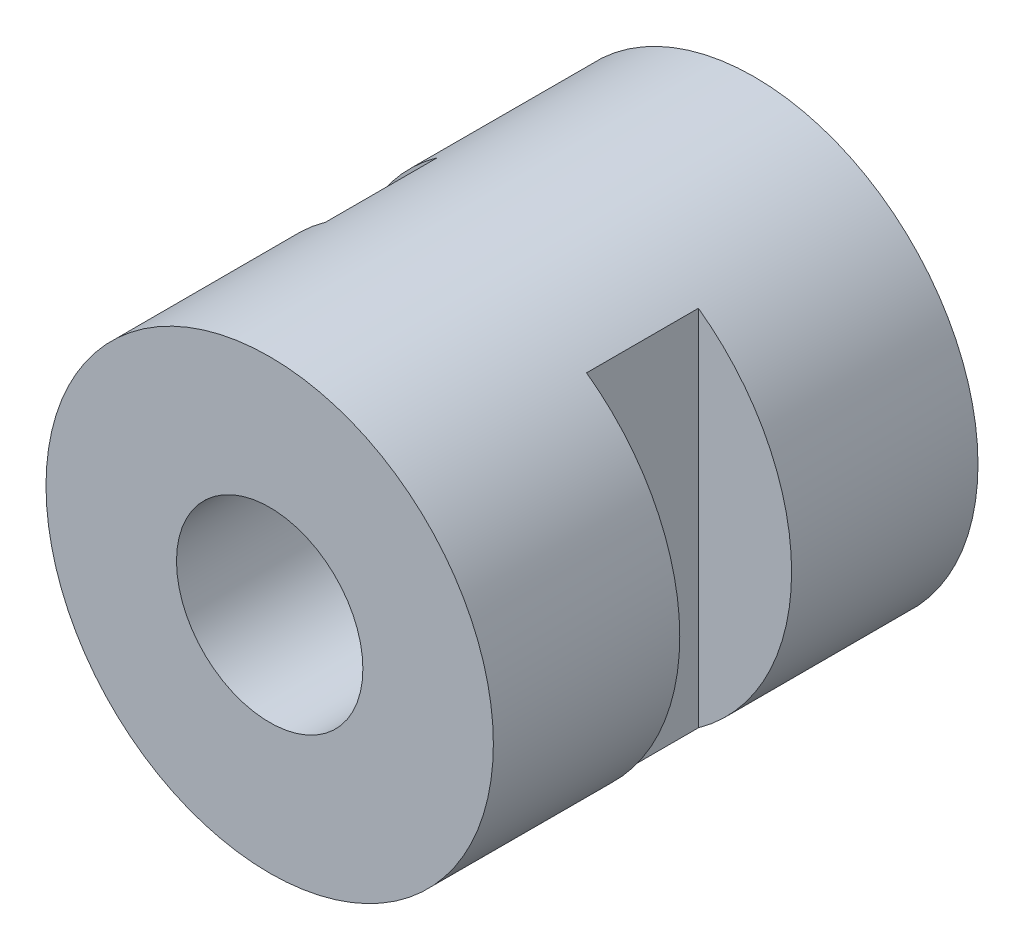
ISO-10303-21;
HEADER;
FILE_DESCRIPTION(('STEP AP214'),'2;1');
FILE_NAME('part.step','',(''),(''),'','','');
FILE_SCHEMA(('AUTOMOTIVE_DESIGN { 1 0 10303 214 1 1 1 1 }'));
ENDSEC;
DATA;
#1=APPLICATION_CONTEXT('core data for automotive mechanical design processes');
#2=APPLICATION_PROTOCOL_DEFINITION('international standard','automotive_design',2000,#1);
#3=PRODUCT_CONTEXT('',#1,'mechanical');
#4=PRODUCT('Part','Part','',(#3));
#5=PRODUCT_RELATED_PRODUCT_CATEGORY('part','',(#4));
#6=PRODUCT_DEFINITION_FORMATION('','',#4);
#7=PRODUCT_DEFINITION_CONTEXT('part definition',#1,'design');
#8=PRODUCT_DEFINITION('design','',#6,#7);
#9=PRODUCT_DEFINITION_SHAPE('','',#8);
#10=(LENGTH_UNIT() NAMED_UNIT(*) SI_UNIT(.MILLI.,.METRE.));
#11=(NAMED_UNIT(*) PLANE_ANGLE_UNIT() SI_UNIT($,.RADIAN.));
#12=(NAMED_UNIT(*) SI_UNIT($,.STERADIAN.) SOLID_ANGLE_UNIT());
#13=UNCERTAINTY_MEASURE_WITH_UNIT(LENGTH_MEASURE(1.E-05),#10,'distance_accuracy_value','');
#14=(GEOMETRIC_REPRESENTATION_CONTEXT(3) GLOBAL_UNCERTAINTY_ASSIGNED_CONTEXT((#13)) GLOBAL_UNIT_ASSIGNED_CONTEXT((#10,
#11,#12)) REPRESENTATION_CONTEXT('',''));
#15=CARTESIAN_POINT('',(0.,0.,0.));
#16=DIRECTION('',(0.,0.,1.));
#17=DIRECTION('',(1.,0.,0.));
#18=AXIS2_PLACEMENT_3D('',#15,#16,#17);
#19=CARTESIAN_POINT('',(0.,0.,13.));
#20=DIRECTION('',(0.,0.,-1.));
#21=DIRECTION('',(-1.,0.,0.));
#22=AXIS2_PLACEMENT_3D('',#19,#20,#21);
#23=CYLINDRICAL_SURFACE('',#22,6.);
#24=CARTESIAN_POINT('',(0.,0.,8.));
#25=DIRECTION('',(0.,0.,1.));
#26=DIRECTION('',(1.,0.,0.));
#27=AXIS2_PLACEMENT_3D('',#24,#25,#26);
#28=CIRCLE('',#27,6.);
#29=CARTESIAN_POINT('',(-3.5,4.87339717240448,8.));
#30=VERTEX_POINT('',#29);
#31=CARTESIAN_POINT('',(-3.5,-4.87339717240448,8.));
#32=VERTEX_POINT('',#31);
#33=EDGE_CURVE('E39',#30,#32,#28,.T.);
#34=ORIENTED_EDGE('',*,*,#33,.T.);
#35=DIRECTION('',(0.,0.,-1.));
#36=VECTOR('',#35,1.);
#37=CARTESIAN_POINT('',(-3.5,-4.87339717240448,13.));
#38=LINE('',#37,#36);
#39=CARTESIAN_POINT('',(-3.5,-4.87339717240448,5.00000000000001));
#40=VERTEX_POINT('',#39);
#41=EDGE_CURVE('E11',#32,#40,#38,.T.);
#42=ORIENTED_EDGE('',*,*,#41,.T.);
#43=CARTESIAN_POINT('',(0.,0.,5.00000000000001));
#44=DIRECTION('',(0.,0.,-1.));
#45=DIRECTION('',(-1.,0.,0.));
#46=AXIS2_PLACEMENT_3D('',#43,#44,#45);
#47=CIRCLE('',#46,6.);
#48=CARTESIAN_POINT('',(-3.5,4.87339717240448,5.00000000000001));
#49=VERTEX_POINT('',#48);
#50=EDGE_CURVE('E83',#40,#49,#47,.T.);
#51=ORIENTED_EDGE('',*,*,#50,.T.);
#52=DIRECTION('',(0.,0.,-1.));
#53=VECTOR('',#52,1.);
#54=CARTESIAN_POINT('',(-3.5,4.87339717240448,13.));
#55=LINE('',#54,#53);
#56=EDGE_CURVE('E82',#49,#30,#55,.F.);
#57=ORIENTED_EDGE('',*,*,#56,.T.);
#58=EDGE_LOOP('',(#34,#42,#51,#57));
#59=FACE_BOUND('',#58,.T.);
#60=DIRECTION('',(0.,0.,-1.));
#61=VECTOR('',#60,1.);
#62=CARTESIAN_POINT('',(3.5,-4.87339717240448,13.));
#63=LINE('',#62,#61);
#64=CARTESIAN_POINT('',(3.5,-4.87339717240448,5.));
#65=VERTEX_POINT('',#64);
#66=CARTESIAN_POINT('',(3.5,-4.87339717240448,8.));
#67=VERTEX_POINT('',#66);
#68=EDGE_CURVE('E93',#65,#67,#63,.F.);
#69=ORIENTED_EDGE('',*,*,#68,.T.);
#70=CARTESIAN_POINT('',(0.,0.,8.));
#71=DIRECTION('',(0.,0.,1.));
#72=DIRECTION('',(1.,0.,0.));
#73=AXIS2_PLACEMENT_3D('',#70,#71,#72);
#74=CIRCLE('',#73,6.);
#75=CARTESIAN_POINT('',(3.5,4.87339717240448,8.));
#76=VERTEX_POINT('',#75);
#77=EDGE_CURVE('E87',#67,#76,#74,.T.);
#78=ORIENTED_EDGE('',*,*,#77,.T.);
#79=DIRECTION('',(0.,0.,-1.));
#80=VECTOR('',#79,1.);
#81=CARTESIAN_POINT('',(3.5,4.87339717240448,13.));
#82=LINE('',#81,#80);
#83=CARTESIAN_POINT('',(3.5,4.87339717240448,5.));
#84=VERTEX_POINT('',#83);
#85=EDGE_CURVE('E90',#76,#84,#82,.T.);
#86=ORIENTED_EDGE('',*,*,#85,.T.);
#87=CARTESIAN_POINT('',(0.,0.,5.));
#88=DIRECTION('',(0.,0.,-1.));
#89=DIRECTION('',(-1.,0.,0.));
#90=AXIS2_PLACEMENT_3D('',#87,#88,#89);
#91=CIRCLE('',#90,6.);
#92=EDGE_CURVE('E96',#84,#65,#91,.T.);
#93=ORIENTED_EDGE('',*,*,#92,.T.);
#94=EDGE_LOOP('',(#69,#78,#86,#93));
#95=FACE_BOUND('',#94,.T.);
#96=CARTESIAN_POINT('',(0.,0.,13.));
#97=DIRECTION('',(0.,0.,1.));
#98=DIRECTION('',(1.,0.,0.));
#99=AXIS2_PLACEMENT_3D('',#96,#97,#98);
#100=CIRCLE('',#99,6.);
#101=CARTESIAN_POINT('',(6.,0.,13.));
#102=VERTEX_POINT('',#101);
#103=EDGE_CURVE('E99',#102,#102,#100,.T.);
#104=ORIENTED_EDGE('',*,*,#103,.F.);
#105=EDGE_LOOP('',(#104));
#106=FACE_BOUND('',#105,.T.);
#107=CARTESIAN_POINT('',(0.,0.,0.));
#108=DIRECTION('',(0.,0.,1.));
#109=DIRECTION('',(1.,0.,0.));
#110=AXIS2_PLACEMENT_3D('',#107,#108,#109);
#111=CIRCLE('',#110,6.);
#112=CARTESIAN_POINT('',(6.,0.,0.));
#113=VERTEX_POINT('',#112);
#114=EDGE_CURVE('E100',#113,#113,#111,.T.);
#115=ORIENTED_EDGE('',*,*,#114,.T.);
#116=EDGE_LOOP('',(#115));
#117=FACE_BOUND('',#116,.T.);
#118=ADVANCED_FACE('F32',(#59,#95,#106,#117),#23,.T.);
#119=CARTESIAN_POINT('',(0.,0.,13.));
#120=DIRECTION('',(0.,0.,1.));
#121=DIRECTION('',(1.,0.,0.));
#122=AXIS2_PLACEMENT_3D('',#119,#120,#121);
#123=PLANE('',#122);
#124=CARTESIAN_POINT('',(0.,0.,13.));
#125=DIRECTION('',(0.,0.,1.));
#126=DIRECTION('',(1.,0.,0.));
#127=AXIS2_PLACEMENT_3D('',#124,#125,#126);
#128=CIRCLE('',#127,2.5);
#129=CARTESIAN_POINT('',(2.5,0.,13.));
#130=VERTEX_POINT('',#129);
#131=EDGE_CURVE('E110',#130,#130,#128,.T.);
#132=ORIENTED_EDGE('',*,*,#131,.F.);
#133=EDGE_LOOP('',(#132));
#134=FACE_BOUND('',#133,.T.);
#135=ORIENTED_EDGE('',*,*,#103,.T.);
#136=EDGE_LOOP('',(#135));
#137=FACE_BOUND('',#136,.T.);
#138=ADVANCED_FACE('F125',(#134,#137),#123,.T.);
#139=CARTESIAN_POINT('',(0.,0.,0.));
#140=DIRECTION('',(0.,0.,1.));
#141=DIRECTION('',(1.,0.,0.));
#142=AXIS2_PLACEMENT_3D('',#139,#140,#141);
#143=PLANE('',#142);
#144=CARTESIAN_POINT('',(0.,0.,0.));
#145=DIRECTION('',(0.,0.,1.));
#146=DIRECTION('',(1.,0.,0.));
#147=AXIS2_PLACEMENT_3D('',#144,#145,#146);
#148=CIRCLE('',#147,2.5);
#149=CARTESIAN_POINT('',(2.5,0.,0.));
#150=VERTEX_POINT('',#149);
#151=EDGE_CURVE('E79',#150,#150,#148,.T.);
#152=ORIENTED_EDGE('',*,*,#151,.T.);
#153=EDGE_LOOP('',(#152));
#154=FACE_BOUND('',#153,.T.);
#155=ORIENTED_EDGE('',*,*,#114,.F.);
#156=EDGE_LOOP('',(#155));
#157=FACE_BOUND('',#156,.T.);
#158=ADVANCED_FACE('F116',(#154,#157),#143,.F.);
#159=CARTESIAN_POINT('',(6.64104690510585,-6.,8.));
#160=DIRECTION('',(0.,0.,1.));
#161=DIRECTION('',(1.,0.,0.));
#162=AXIS2_PLACEMENT_3D('',#159,#160,#161);
#163=PLANE('',#162);
#164=DIRECTION('',(0.,1.,0.));
#165=VECTOR('',#164,1.);
#166=CARTESIAN_POINT('',(3.5,-6.,8.));
#167=LINE('',#166,#165);
#168=EDGE_CURVE('E103',#67,#76,#167,.T.);
#169=ORIENTED_EDGE('',*,*,#168,.T.);
#170=ORIENTED_EDGE('',*,*,#77,.F.);
#171=EDGE_LOOP('',(#169,#170));
#172=FACE_BOUND('',#171,.T.);
#173=ADVANCED_FACE('F135',(#172),#163,.F.);
#174=CARTESIAN_POINT('',(3.5,-6.,8.));
#175=DIRECTION('',(-1.,0.,0.));
#176=DIRECTION('',(0.,0.,1.));
#177=AXIS2_PLACEMENT_3D('',#174,#175,#176);
#178=PLANE('',#177);
#179=ORIENTED_EDGE('',*,*,#168,.F.);
#180=ORIENTED_EDGE('',*,*,#68,.F.);
#181=DIRECTION('',(0.,1.,0.));
#182=VECTOR('',#181,1.);
#183=CARTESIAN_POINT('',(3.5,-6.,5.));
#184=LINE('',#183,#182);
#185=EDGE_CURVE('E53',#65,#84,#184,.T.);
#186=ORIENTED_EDGE('',*,*,#185,.T.);
#187=ORIENTED_EDGE('',*,*,#85,.F.);
#188=EDGE_LOOP('',(#179,#180,#186,#187));
#189=FACE_BOUND('',#188,.T.);
#190=ADVANCED_FACE('F139',(#189),#178,.F.);
#191=CARTESIAN_POINT('',(6.64104690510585,-6.,5.));
#192=DIRECTION('',(0.,0.,-1.));
#193=DIRECTION('',(-1.,0.,0.));
#194=AXIS2_PLACEMENT_3D('',#191,#192,#193);
#195=PLANE('',#194);
#196=ORIENTED_EDGE('',*,*,#185,.F.);
#197=ORIENTED_EDGE('',*,*,#92,.F.);
#198=EDGE_LOOP('',(#196,#197));
#199=FACE_BOUND('',#198,.T.);
#200=ADVANCED_FACE('F143',(#199),#195,.F.);
#201=CARTESIAN_POINT('',(-6.64104690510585,-6.,8.));
#202=DIRECTION('',(0.,0.,1.));
#203=DIRECTION('',(1.,0.,0.));
#204=AXIS2_PLACEMENT_3D('',#201,#202,#203);
#205=PLANE('',#204);
#206=DIRECTION('',(0.,1.,0.));
#207=VECTOR('',#206,1.);
#208=CARTESIAN_POINT('',(-3.5,-6.,8.));
#209=LINE('',#208,#207);
#210=EDGE_CURVE('E46',#32,#30,#209,.T.);
#211=ORIENTED_EDGE('',*,*,#210,.F.);
#212=ORIENTED_EDGE('',*,*,#33,.F.);
#213=EDGE_LOOP('',(#211,#212));
#214=FACE_BOUND('',#213,.T.);
#215=ADVANCED_FACE('F77',(#214),#205,.F.);
#216=CARTESIAN_POINT('',(-6.64104690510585,-6.,5.));
#217=DIRECTION('',(0.,0.,-1.));
#218=DIRECTION('',(-1.,0.,0.));
#219=AXIS2_PLACEMENT_3D('',#216,#217,#218);
#220=PLANE('',#219);
#221=DIRECTION('',(0.,1.,0.));
#222=VECTOR('',#221,1.);
#223=CARTESIAN_POINT('',(-3.5,-6.,5.00000000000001));
#224=LINE('',#223,#222);
#225=EDGE_CURVE('E72',#40,#49,#224,.T.);
#226=ORIENTED_EDGE('',*,*,#225,.T.);
#227=ORIENTED_EDGE('',*,*,#50,.F.);
#228=EDGE_LOOP('',(#226,#227));
#229=FACE_BOUND('',#228,.T.);
#230=ADVANCED_FACE('F151',(#229),#220,.F.);
#231=CARTESIAN_POINT('',(-3.5,-6.,8.));
#232=DIRECTION('',(1.,0.,0.));
#233=DIRECTION('',(0.,0.,-1.));
#234=AXIS2_PLACEMENT_3D('',#231,#232,#233);
#235=PLANE('',#234);
#236=ORIENTED_EDGE('',*,*,#210,.T.);
#237=ORIENTED_EDGE('',*,*,#56,.F.);
#238=ORIENTED_EDGE('',*,*,#225,.F.);
#239=ORIENTED_EDGE('',*,*,#41,.F.);
#240=EDGE_LOOP('',(#236,#237,#238,#239));
#241=FACE_BOUND('',#240,.T.);
#242=ADVANCED_FACE('F70',(#241),#235,.F.);
#243=CARTESIAN_POINT('',(0.,0.,0.));
#244=DIRECTION('',(0.,0.,1.));
#245=DIRECTION('',(1.,0.,0.));
#246=AXIS2_PLACEMENT_3D('',#243,#244,#245);
#247=CYLINDRICAL_SURFACE('',#246,2.5);
#248=CARTESIAN_POINT('',(2.5,0.,0.));
#249=CARTESIAN_POINT('',(2.5,0.,0.135416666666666));
#250=CARTESIAN_POINT('',(2.5,0.,0.270833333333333));
#251=CARTESIAN_POINT('',(2.5,0.,0.541666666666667));
#252=CARTESIAN_POINT('',(2.5,0.,0.677083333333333));
#253=CARTESIAN_POINT('',(2.5,0.,0.947916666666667));
#254=CARTESIAN_POINT('',(2.5,0.,1.08333333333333));
#255=CARTESIAN_POINT('',(2.5,0.,1.35416666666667));
#256=CARTESIAN_POINT('',(2.5,0.,1.48958333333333));
#257=CARTESIAN_POINT('',(2.5,0.,1.76041666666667));
#258=CARTESIAN_POINT('',(2.5,0.,1.89583333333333));
#259=CARTESIAN_POINT('',(2.5,0.,2.16666666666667));
#260=CARTESIAN_POINT('',(2.5,0.,2.30208333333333));
#261=CARTESIAN_POINT('',(2.5,0.,2.57291666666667));
#262=CARTESIAN_POINT('',(2.5,0.,2.70833333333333));
#263=CARTESIAN_POINT('',(2.5,0.,2.97916666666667));
#264=CARTESIAN_POINT('',(2.5,0.,3.11458333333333));
#265=CARTESIAN_POINT('',(2.5,0.,3.38541666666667));
#266=CARTESIAN_POINT('',(2.5,0.,3.52083333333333));
#267=CARTESIAN_POINT('',(2.5,0.,3.79166666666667));
#268=CARTESIAN_POINT('',(2.5,0.,3.92708333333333));
#269=CARTESIAN_POINT('',(2.5,0.,4.19791666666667));
#270=CARTESIAN_POINT('',(2.5,0.,4.33333333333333));
#271=CARTESIAN_POINT('',(2.5,0.,4.60416666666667));
#272=CARTESIAN_POINT('',(2.5,0.,4.73958333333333));
#273=CARTESIAN_POINT('',(2.5,0.,5.01041666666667));
#274=CARTESIAN_POINT('',(2.5,0.,5.14583333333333));
#275=CARTESIAN_POINT('',(2.5,0.,5.41666666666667));
#276=CARTESIAN_POINT('',(2.5,0.,5.55208333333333));
#277=CARTESIAN_POINT('',(2.5,0.,5.82291666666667));
#278=CARTESIAN_POINT('',(2.5,0.,5.95833333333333));
#279=CARTESIAN_POINT('',(2.5,0.,6.22916666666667));
#280=CARTESIAN_POINT('',(2.5,0.,6.36458333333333));
#281=CARTESIAN_POINT('',(2.5,0.,6.63541666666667));
#282=CARTESIAN_POINT('',(2.5,0.,6.77083333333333));
#283=CARTESIAN_POINT('',(2.5,0.,7.04166666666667));
#284=CARTESIAN_POINT('',(2.5,0.,7.17708333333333));
#285=CARTESIAN_POINT('',(2.5,0.,7.44791666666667));
#286=CARTESIAN_POINT('',(2.5,0.,7.58333333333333));
#287=CARTESIAN_POINT('',(2.5,0.,7.85416666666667));
#288=CARTESIAN_POINT('',(2.5,0.,7.98958333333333));
#289=CARTESIAN_POINT('',(2.5,0.,8.26041666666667));
#290=CARTESIAN_POINT('',(2.5,0.,8.39583333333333));
#291=CARTESIAN_POINT('',(2.5,0.,8.66666666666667));
#292=CARTESIAN_POINT('',(2.5,0.,8.80208333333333));
#293=CARTESIAN_POINT('',(2.5,0.,9.07291666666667));
#294=CARTESIAN_POINT('',(2.5,0.,9.20833333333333));
#295=CARTESIAN_POINT('',(2.5,0.,9.47916666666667));
#296=CARTESIAN_POINT('',(2.5,0.,9.61458333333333));
#297=CARTESIAN_POINT('',(2.5,0.,9.88541666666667));
#298=CARTESIAN_POINT('',(2.5,0.,10.0208333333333));
#299=CARTESIAN_POINT('',(2.5,0.,10.2916666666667));
#300=CARTESIAN_POINT('',(2.5,0.,10.4270833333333));
#301=CARTESIAN_POINT('',(2.5,0.,10.6979166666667));
#302=CARTESIAN_POINT('',(2.5,0.,10.8333333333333));
#303=CARTESIAN_POINT('',(2.5,0.,11.1041666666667));
#304=CARTESIAN_POINT('',(2.5,0.,11.2395833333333));
#305=CARTESIAN_POINT('',(2.5,0.,11.5104166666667));
#306=CARTESIAN_POINT('',(2.5,0.,11.6458333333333));
#307=CARTESIAN_POINT('',(2.5,0.,11.9166666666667));
#308=CARTESIAN_POINT('',(2.5,0.,12.0520833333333));
#309=CARTESIAN_POINT('',(2.5,0.,12.3229166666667));
#310=CARTESIAN_POINT('',(2.5,0.,12.4583333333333));
#311=CARTESIAN_POINT('',(2.5,0.,12.7291666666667));
#312=CARTESIAN_POINT('',(2.5,0.,12.8645833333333));
#313=CARTESIAN_POINT('',(2.5,0.,13.));
#314=B_SPLINE_CURVE_WITH_KNOTS('',3,(#248,#249,#250,#251,#252,#253,#254,#255,#256,#257,#258,
#259,#260,#261,#262,#263,#264,#265,#266,#267,#268,#269,#270,#271,#272,#273,#274,#275,#276,#277,
#278,#279,#280,#281,#282,#283,#284,#285,#286,#287,#288,#289,#290,#291,#292,#293,#294,#295,#296,
#297,#298,#299,#300,#301,#302,#303,#304,#305,#306,#307,#308,#309,#310,#311,#312,#313),
.UNSPECIFIED.,.F.,.F.,(4,2,2,2,2,2,2,2,2,2,2,2,2,2,2,2,2,2,2,2,2,2,2,2,2,2,2,2,2,2,2,2,4),(0.,
0.40625,0.8125,1.21875,1.625,2.03125,2.4375,2.84375,3.25,3.65625,4.0625,4.46875,4.875,5.28125,
5.6875,6.09375,6.5,6.90625,7.3125,7.71875,8.125,8.53125,8.9375,9.34375,9.75,10.15625,10.5625,
10.96875,11.375,11.78125,12.1875,12.59375,13.),.UNSPECIFIED.);
#315=EDGE_CURVE('BSEAM119',#150,#130,#314,.T.);
#316=ORIENTED_EDGE('',*,*,#151,.F.);
#317=ORIENTED_EDGE('',*,*,#131,.T.);
#318=ORIENTED_EDGE('',*,*,#315,.T.);
#319=ORIENTED_EDGE('',*,*,#315,.F.);
#320=EDGE_LOOP('',(#316,#318,#317,#319));
#321=FACE_BOUND('',#320,.T.);
#322=ADVANCED_FACE('F119',(#321),#247,.F.);
#323=CLOSED_SHELL('',(#118,#138,#158,#173,#190,#200,#215,#230,#242,#322));
#324=MANIFOLD_SOLID_BREP('B2',#323);
#325=ADVANCED_BREP_SHAPE_REPRESENTATION('',(#18,#324),#14);
#326=SHAPE_DEFINITION_REPRESENTATION(#9,#325);
ENDSEC;
END-ISO-10303-21;
